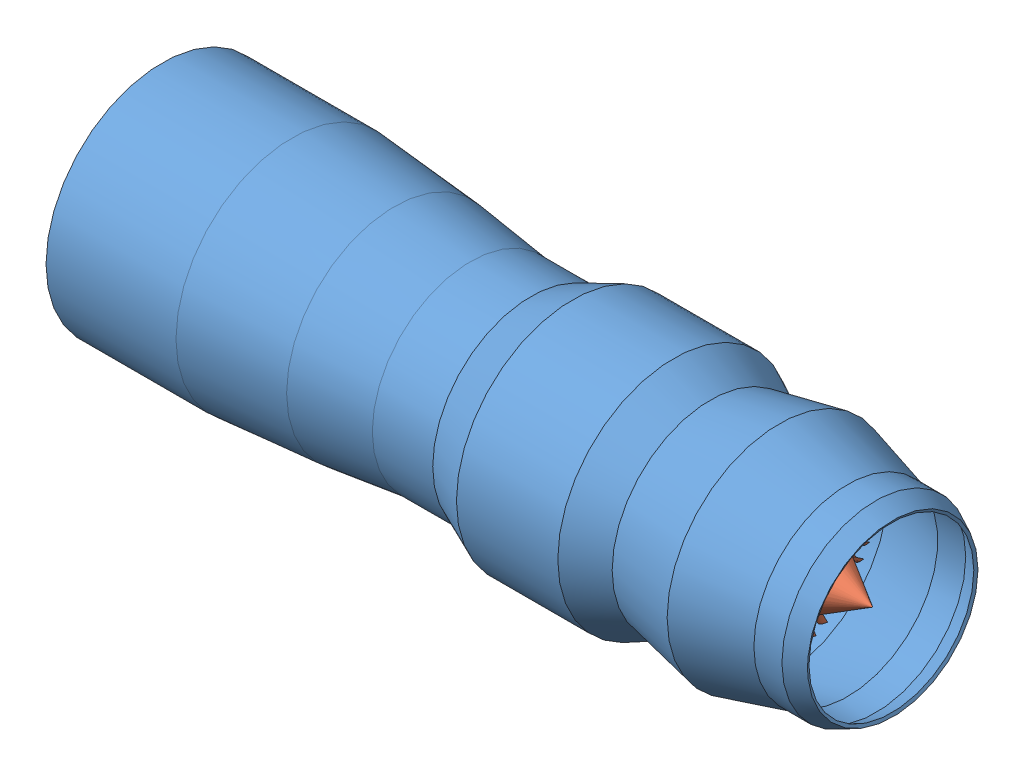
SolidWorks assembly Assem1.SLDASM, configuration Default (file format 9000). Lengths in mm.
Overall size (877 312.91 312.74).
2 component instances, 2 part files, 1 mates.
Components (placement in the parent):
- Shell - outer cover-1: Shell - outer cover.SLDPRT [Default] at origin size (811.84 258.56 258.56)
- Turbine rotor-1: Turbine rotor.SLDPRT [Default] at (-3.1673 5.8338 24.4042) x (1 0 0) z (0 0.452255 0.891889) size (854.72 232.93 232.53)
Mates (geometry in assembly coordinates):
- Concentric1: concentric: cylinder of Shell - outer cover-1 through (-442.9556 53.9612 0) axis (-1 0 0) radius 100.2729; cylinder of Turbine rotor-1 through (-446.1229 53.9612 0) axis (-1 0 0) radius 81.8612
